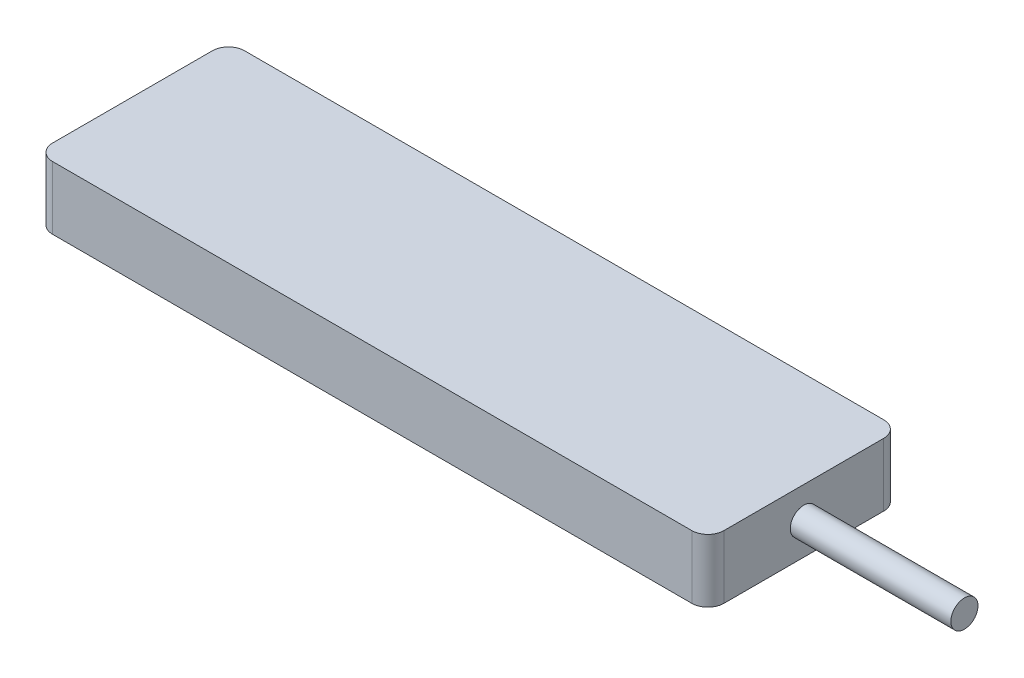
from build123d import *

# Parameters (mm, degrees)
SKETCH1_W           = 106.172
SKETCH1_H           = 30.353
BOSS_EXTRUDE1_DEPTH = 9.9695
FILLET1_R           = 2.54
SKETCH2_W           = 12.573
SKETCH2_H           = 5.08
CUT_EXTRUDE1_DEPTH  = 8.636
SKETCH3_R           = 2.1463
BOSS_EXTRUDE2_DEPTH = 25.4


with BuildPart() as part:
    # Sketch1 → Boss-Extrude1 (new body)
    with BuildSketch(Plane(origin=(0, 0, 0), x_dir=(1, 0, 0), z_dir=(0, 1, 0))):
        with Locations((53.086, 15.1765)):
            Rectangle(SKETCH1_W, SKETCH1_H)
    extrude(amount=BOSS_EXTRUDE1_DEPTH)

    # Fillet1
    fillet1_edges = [part.edges().sort_by_distance(p)[0] for p in [
        (0, 4.98475, -30.353),
        (106.172, 4.98475, -30.353),
        (106.172, 4.98475, 0),
        (0, 4.98475, 0),
    ]]
    fillet(fillet1_edges, radius=FILLET1_R)

    # Sketch2 → Cut-Extrude1 (cut)
    with BuildSketch(Plane(origin=(0, 0, -30.353), x_dir=(-1, 0, 0), z_dir=(0, 0, -1))):
        with Locations((-70.0532, 4.98475)):
            Rectangle(SKETCH2_W, SKETCH2_H)
        with Locations((-50.1777, 4.98475)):
            Rectangle(SKETCH2_W, SKETCH2_H)
        with Locations((-30.3022, 4.98475)):
            Rectangle(SKETCH2_W, SKETCH2_H)
        with Locations((-10.4267, 4.98475)):
            Rectangle(SKETCH2_W, SKETCH2_H)
    extrude(amount=-CUT_EXTRUDE1_DEPTH, mode=Mode.SUBTRACT)

    # Sketch3 → Boss-Extrude2 (add)
    with BuildSketch(Plane(origin=(106.172, 0, 0), x_dir=(0, 0, -1), z_dir=(1, 0, 0))):
        with Locations(Location((15.1765, 4.98475, 0), (0, 0, 180))):
            Circle(SKETCH3_R)
    extrude(amount=BOSS_EXTRUDE2_DEPTH)


solid = part.part
